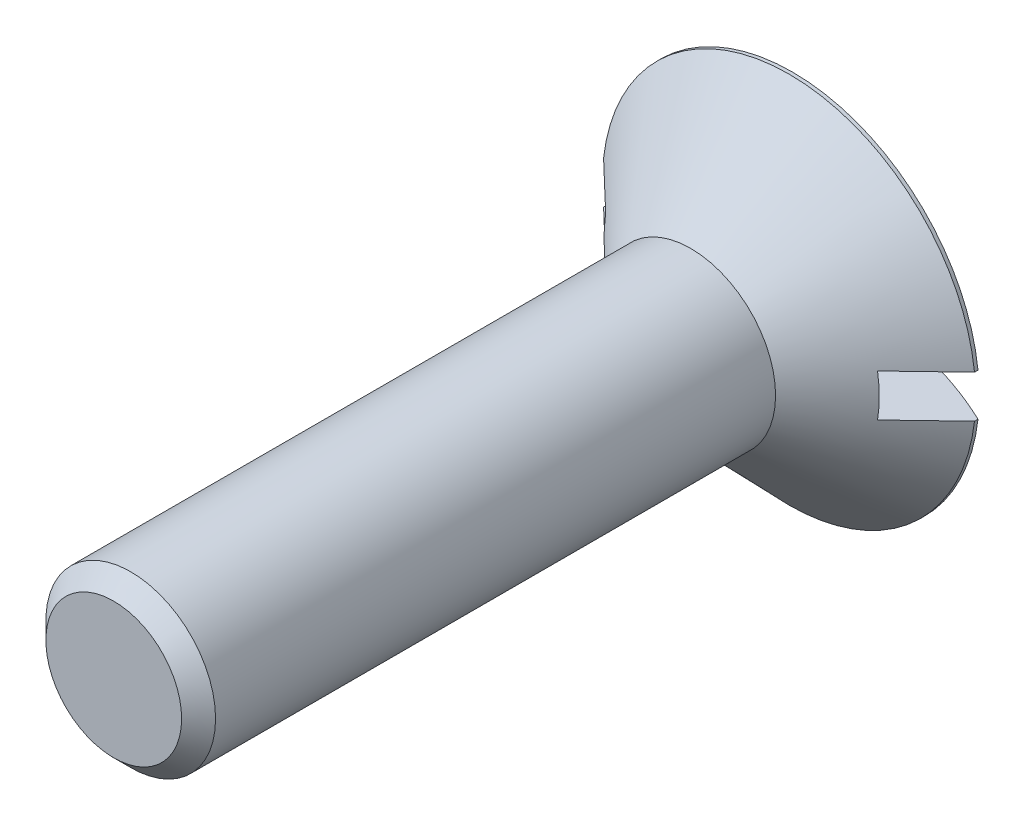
ISO-10303-21;
HEADER;
FILE_DESCRIPTION(('STEP AP214'),'2;1');
FILE_NAME('part.step','',(''),(''),'','','');
FILE_SCHEMA(('AUTOMOTIVE_DESIGN { 1 0 10303 214 1 1 1 1 }'));
ENDSEC;
DATA;
#1=APPLICATION_CONTEXT('core data for automotive mechanical design processes');
#2=APPLICATION_PROTOCOL_DEFINITION('international standard','automotive_design',2000,#1);
#3=PRODUCT_CONTEXT('',#1,'mechanical');
#4=PRODUCT('Part','Part','',(#3));
#5=PRODUCT_RELATED_PRODUCT_CATEGORY('part','',(#4));
#6=PRODUCT_DEFINITION_FORMATION('','',#4);
#7=PRODUCT_DEFINITION_CONTEXT('part definition',#1,'design');
#8=PRODUCT_DEFINITION('design','',#6,#7);
#9=PRODUCT_DEFINITION_SHAPE('','',#8);
#10=(LENGTH_UNIT() NAMED_UNIT(*) SI_UNIT(.MILLI.,.METRE.));
#11=(NAMED_UNIT(*) PLANE_ANGLE_UNIT() SI_UNIT($,.RADIAN.));
#12=(NAMED_UNIT(*) SI_UNIT($,.STERADIAN.) SOLID_ANGLE_UNIT());
#13=UNCERTAINTY_MEASURE_WITH_UNIT(LENGTH_MEASURE(1.E-05),#10,'distance_accuracy_value','');
#14=(GEOMETRIC_REPRESENTATION_CONTEXT(3) GLOBAL_UNCERTAINTY_ASSIGNED_CONTEXT((#13)) GLOBAL_UNIT_ASSIGNED_CONTEXT((#10,
#11,#12)) REPRESENTATION_CONTEXT('',''));
#15=CARTESIAN_POINT('',(0.,0.,0.));
#16=DIRECTION('',(0.,0.,1.));
#17=DIRECTION('',(1.,0.,0.));
#18=AXIS2_PLACEMENT_3D('',#15,#16,#17);
#19=CARTESIAN_POINT('',(0.,0.,0.));
#20=DIRECTION('',(0.,0.,-0.999999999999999));
#21=DIRECTION('',(-1.,0.,0.));
#22=AXIS2_PLACEMENT_3D('',#19,#20,#21);
#23=CYLINDRICAL_SURFACE('',#22,2.2);
#24=CARTESIAN_POINT('',(0.,0.,-1.15882652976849));
#25=DIRECTION('',(0.,0.,-0.999999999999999));
#26=DIRECTION('',(-1.,0.,0.));
#27=AXIS2_PLACEMENT_3D('',#24,#25,#26);
#28=CIRCLE('',#27,2.2);
#29=CARTESIAN_POINT('',(-2.18574929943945,0.250000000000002,-1.15882652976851));
#30=VERTEX_POINT('',#29);
#31=CARTESIAN_POINT('',(2.18574929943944,0.25,-1.15882652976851));
#32=VERTEX_POINT('',#31);
#33=EDGE_CURVE('E147',#30,#32,#28,.T.);
#34=ORIENTED_EDGE('',*,*,#33,.T.);
#35=DIRECTION('',(0.,0.,-0.999999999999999));
#36=VECTOR('',#35,1.);
#37=CARTESIAN_POINT('',(2.18574929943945,0.250000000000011,0.));
#38=LINE('',#37,#36);
#39=CARTESIAN_POINT('',(2.18574929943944,0.25,-1.20000000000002));
#40=VERTEX_POINT('',#39);
#41=EDGE_CURVE('E57',#32,#40,#38,.T.);
#42=ORIENTED_EDGE('',*,*,#41,.T.);
#43=CARTESIAN_POINT('',(0.,0.,-1.2));
#44=DIRECTION('',(0.,0.,-0.999999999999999));
#45=DIRECTION('',(-1.,0.,0.));
#46=AXIS2_PLACEMENT_3D('',#43,#44,#45);
#47=CIRCLE('',#46,2.2);
#48=CARTESIAN_POINT('',(-2.18574929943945,0.250000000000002,-1.20000000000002));
#49=VERTEX_POINT('',#48);
#50=EDGE_CURVE('E155',#49,#40,#47,.T.);
#51=ORIENTED_EDGE('',*,*,#50,.F.);
#52=DIRECTION('',(0.,0.,-0.999999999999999));
#53=VECTOR('',#52,1.);
#54=CARTESIAN_POINT('',(-2.18574929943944,0.250000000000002,0.));
#55=LINE('',#54,#53);
#56=EDGE_CURVE('E109',#49,#30,#55,.F.);
#57=ORIENTED_EDGE('',*,*,#56,.T.);
#58=EDGE_LOOP('',(#34,#42,#51,#57));
#59=FACE_BOUND('',#58,.T.);
#60=ADVANCED_FACE('F33',(#59),#23,.T.);
#61=CARTESIAN_POINT('',(0.,0.,3.38999999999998));
#62=DIRECTION('',(0.,0.,-0.999999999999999));
#63=DIRECTION('',(1.,0.,0.));
#64=AXIS2_PLACEMENT_3D('',#61,#62,#63);
#65=SPHERICAL_SURFACE('',#64,5.09);
#66=ORIENTED_EDGE('',*,*,#50,.T.);
#67=CARTESIAN_POINT('',(0.,0.249999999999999,3.38999999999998));
#68=DIRECTION('',(0.,1.,0.));
#69=DIRECTION('',(0.,0.,0.999999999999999));
#70=AXIS2_PLACEMENT_3D('',#67,#68,#69);
#71=CIRCLE('',#70,5.08385680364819);
#72=EDGE_CURVE('E153',#40,#49,#71,.T.);
#73=ORIENTED_EDGE('',*,*,#72,.T.);
#74=EDGE_LOOP('',(#66,#73));
#75=FACE_BOUND('',#74,.T.);
#76=ADVANCED_FACE('F133',(#75),#65,.T.);
#77=CARTESIAN_POINT('',(0.,0.,0.));
#78=DIRECTION('',(0.,0.,-0.999999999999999));
#79=DIRECTION('',(-1.,0.,0.));
#80=AXIS2_PLACEMENT_3D('',#77,#78,#79);
#81=CONICAL_SURFACE('',#80,1.,0.802851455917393);
#82=CARTESIAN_POINT('',(0.,0.,-0.6));
#83=DIRECTION('',(0.,0.,-0.999999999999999));
#84=DIRECTION('',(-1.,0.,0.));
#85=AXIS2_PLACEMENT_3D('',#82,#83,#84);
#86=CIRCLE('',#85,1.62131818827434);
#87=CARTESIAN_POINT('',(1.60192779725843,0.250000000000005,-0.600000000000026));
#88=VERTEX_POINT('',#87);
#89=CARTESIAN_POINT('',(1.60192779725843,-0.25,-0.599999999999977));
#90=VERTEX_POINT('',#89);
#91=EDGE_CURVE('E88',#88,#90,#86,.T.);
#92=ORIENTED_EDGE('',*,*,#91,.F.);
#93=CARTESIAN_POINT('',(-4.86140712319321,0.249999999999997,-3.73512103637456));
#94=CARTESIAN_POINT('',(-4.69409851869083,0.249999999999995,-3.5737679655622));
#95=CARTESIAN_POINT('',(-4.5267805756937,0.249999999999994,-3.41242457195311));
#96=CARTESIAN_POINT('',(-4.19211225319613,0.249999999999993,-3.08976822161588));
#97=CARTESIAN_POINT('',(-4.02476187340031,0.249999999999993,-2.92845526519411));
#98=CARTESIAN_POINT('',(-3.68998286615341,0.249999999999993,-2.60583998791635));
#99=CARTESIAN_POINT('',(-3.52255422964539,0.249999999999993,-2.44453767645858));
#100=CARTESIAN_POINT('',(-3.18763349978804,0.249999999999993,-2.12200206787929));
#101=CARTESIAN_POINT('',(-3.02014140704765,0.249999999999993,-1.96076877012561));
#102=CARTESIAN_POINT('',(-2.68004730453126,0.249999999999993,-1.63359802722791));
#103=CARTESIAN_POINT('',(-2.50744209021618,0.249999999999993,-1.46766391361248));
#104=CARTESIAN_POINT('',(-2.16203156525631,0.249999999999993,-1.13599426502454));
#105=CARTESIAN_POINT('',(-1.9892262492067,0.249999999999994,-0.970258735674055));
#106=CARTESIAN_POINT('',(-1.7297145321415,0.249999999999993,-0.721996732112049));
#107=CARTESIAN_POINT('',(-1.64316596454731,0.249999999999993,-0.639305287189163));
#108=CARTESIAN_POINT('',(-1.4698992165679,0.249999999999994,-0.474098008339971));
#109=CARTESIAN_POINT('',(-1.38318103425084,0.249999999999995,-0.391582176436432));
#110=CARTESIAN_POINT('',(-1.20946067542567,0.249999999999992,-0.226859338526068));
#111=CARTESIAN_POINT('',(-1.12245851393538,0.249999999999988,-0.144652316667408));
#112=CARTESIAN_POINT('',(-0.947929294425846,0.249999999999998,0.0192021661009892));
#113=CARTESIAN_POINT('',(-0.860402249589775,0.250000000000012,0.10084964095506));
#114=CARTESIAN_POINT('',(-0.749737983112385,0.249999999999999,0.202512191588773));
#115=CARTESIAN_POINT('',(-0.727178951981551,0.249999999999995,0.223155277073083));
#116=CARTESIAN_POINT('',(-0.681948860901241,0.249999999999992,0.264318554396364));
#117=CARTESIAN_POINT('',(-0.659277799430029,0.249999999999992,0.284838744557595));
#118=CARTESIAN_POINT('',(-0.591184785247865,0.249999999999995,0.346053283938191));
#119=CARTESIAN_POINT('',(-0.545555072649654,0.249999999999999,0.386519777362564));
#120=CARTESIAN_POINT('',(-0.468454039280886,0.249999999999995,0.453089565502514));
#121=CARTESIAN_POINT('',(-0.437274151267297,0.249999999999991,0.479530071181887));
#122=CARTESIAN_POINT('',(-0.373959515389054,0.249999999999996,0.53160132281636));
#123=CARTESIAN_POINT('',(-0.341820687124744,0.250000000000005,0.557227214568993));
#124=CARTESIAN_POINT('',(-0.292338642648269,0.25,0.594362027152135));
#125=CARTESIAN_POINT('',(-0.275536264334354,0.249999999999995,0.606586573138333));
#126=CARTESIAN_POINT('',(-0.241409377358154,0.249999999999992,0.630278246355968));
#127=CARTESIAN_POINT('',(-0.224085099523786,0.249999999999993,0.641745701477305));
#128=CARTESIAN_POINT('',(-0.188815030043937,0.249999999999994,0.663431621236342));
#129=CARTESIAN_POINT('',(-0.170874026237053,0.249999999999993,0.673657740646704));
#130=CARTESIAN_POINT('',(-0.134038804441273,0.249999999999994,0.692175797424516));
#131=CARTESIAN_POINT('',(-0.115147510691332,0.249999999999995,0.70047327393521));
#132=CARTESIAN_POINT('',(-0.0803697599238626,0.249999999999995,0.712471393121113));
#133=CARTESIAN_POINT('',(-0.0647001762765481,0.249999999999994,0.716774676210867));
#134=CARTESIAN_POINT('',(-0.0328905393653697,0.249999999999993,0.72264730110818));
#135=CARTESIAN_POINT('',(-0.0167527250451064,0.249999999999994,0.724227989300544));
#136=CARTESIAN_POINT('',(0.0155936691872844,0.249999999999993,0.724303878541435));
#137=CARTESIAN_POINT('',(0.0318022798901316,0.249999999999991,0.722787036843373));
#138=CARTESIAN_POINT('',(0.0637518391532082,0.249999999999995,0.717007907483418));
#139=CARTESIAN_POINT('',(0.0794907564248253,0.250000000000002,0.712735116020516));
#140=CARTESIAN_POINT('',(0.112072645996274,0.250000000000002,0.701576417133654));
#141=CARTESIAN_POINT('',(0.128826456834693,0.249999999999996,0.694441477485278));
#142=CARTESIAN_POINT('',(0.161567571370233,0.249999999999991,0.678563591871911));
#143=CARTESIAN_POINT('',(0.177553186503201,0.249999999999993,0.669817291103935));
#144=CARTESIAN_POINT('',(0.20903325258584,0.249999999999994,0.651225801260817));
#145=CARTESIAN_POINT('',(0.224522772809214,0.249999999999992,0.641372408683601));
#146=CARTESIAN_POINT('',(0.255018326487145,0.249999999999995,0.620984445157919));
#147=CARTESIAN_POINT('',(0.270024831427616,0.249999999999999,0.610450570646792));
#148=CARTESIAN_POINT('',(0.317724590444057,0.250000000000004,0.575843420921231));
#149=CARTESIAN_POINT('',(0.349758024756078,0.249999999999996,0.550867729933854));
#150=CARTESIAN_POINT('',(0.41294269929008,0.24999999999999,0.499818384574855));
#151=CARTESIAN_POINT('',(0.444093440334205,0.249999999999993,0.473744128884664));
#152=CARTESIAN_POINT('',(0.505905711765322,0.249999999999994,0.420923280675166));
#153=CARTESIAN_POINT('',(0.536566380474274,0.249999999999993,0.394175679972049));
#154=CARTESIAN_POINT('',(0.59753469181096,0.249999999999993,0.340298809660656));
#155=CARTESIAN_POINT('',(0.627842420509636,0.249999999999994,0.313169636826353));
#156=CARTESIAN_POINT('',(0.718178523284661,0.249999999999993,0.231628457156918));
#157=CARTESIAN_POINT('',(0.777870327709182,0.24999999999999,0.17684410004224));
#158=CARTESIAN_POINT('',(0.896743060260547,0.249999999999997,0.0668337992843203));
#159=CARTESIAN_POINT('',(0.955924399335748,0.250000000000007,0.0116082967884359));
#160=CARTESIAN_POINT('',(1.13271176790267,0.250000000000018,-0.154142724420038));
#161=CARTESIAN_POINT('',(1.24992974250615,0.25,-0.265081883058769));
#162=CARTESIAN_POINT('',(1.48394572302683,0.249999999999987,-0.487404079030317));
#163=CARTESIAN_POINT('',(1.60074372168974,0.249999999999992,-0.598787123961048));
#164=CARTESIAN_POINT('',(1.83415197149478,0.249999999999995,-0.821833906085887));
#165=CARTESIAN_POINT('',(1.95076214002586,0.249999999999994,-0.93349772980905));
#166=CARTESIAN_POINT('',(2.18384967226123,0.249999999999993,-1.15696223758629));
#167=CARTESIAN_POINT('',(2.30032703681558,0.249999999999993,-1.26876292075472));
#168=CARTESIAN_POINT('',(2.64978088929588,0.249999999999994,-1.60443163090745));
#169=CARTESIAN_POINT('',(2.88263439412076,0.249999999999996,-1.82842769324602));
#170=CARTESIAN_POINT('',(3.34816980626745,0.249999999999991,-2.27655461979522));
#171=CARTESIAN_POINT('',(3.58085172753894,0.249999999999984,-2.50068546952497));
#172=CARTESIAN_POINT('',(3.90085212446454,0.249999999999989,-2.80904465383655));
#173=CARTESIAN_POINT('',(3.98820767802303,0.249999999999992,-2.89323450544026));
#174=CARTESIAN_POINT('',(4.16291039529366,0.249999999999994,-3.06162641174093));
#175=CARTESIAN_POINT('',(4.25025755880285,0.249999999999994,-3.14582846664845));
#176=CARTESIAN_POINT('',(4.42491001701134,0.249999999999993,-3.31420894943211));
#177=CARTESIAN_POINT('',(4.51221531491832,0.249999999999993,-3.3983873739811));
#178=CARTESIAN_POINT('',(4.68681708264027,0.249999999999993,-3.56674987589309));
#179=CARTESIAN_POINT('',(4.77411355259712,0.249999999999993,-3.65093395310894));
#180=CARTESIAN_POINT('',(4.86140712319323,0.249999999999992,-3.73512103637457));
#181=B_SPLINE_CURVE_WITH_KNOTS('',3,(#93,#94,#95,#96,#97,#98,#99,#100,#101,#102,#103,#104,#105,
#106,#107,#108,#109,#110,#111,#112,#113,#114,#115,#116,#117,#118,#119,#120,#121,#122,#123,#124,
#125,#126,#127,#128,#129,#130,#131,#132,#133,#134,#135,#136,#137,#138,#139,#140,#141,#142,#143,
#144,#145,#146,#147,#148,#149,#150,#151,#152,#153,#154,#155,#156,#157,#158,#159,#160,#161,#162,
#163,#164,#165,#166,#167,#168,#169,#170,#171,#172,#173,#174,#175,#176,#177,#178,#179,#180),
.UNSPECIFIED.,.F.,.F.,(4,2,2,2,2,2,2,2,2,2,2,2,2,2,2,2,2,2,2,2,2,2,2,2,2,2,2,2,2,2,2,2,2,2,2,2,
2,2,2,2,2,2,2,4),(0.,0.697311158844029,1.39462899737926,2.0920937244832,2.7895519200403,
3.50784168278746,4.22615132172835,4.58525675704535,4.94436630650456,5.30345716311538,
5.66253903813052,5.75427410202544,5.84601041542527,6.02896056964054,6.15159884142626,
6.27486673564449,6.3371906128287,6.39948731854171,6.46137791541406,6.52308850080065,
6.57165687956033,6.6200223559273,6.66857622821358,6.71731625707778,6.77181304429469,
6.82642460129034,6.88147146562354,6.93646285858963,7.05825778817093,7.18012027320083,
7.30217757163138,7.4242044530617,7.66726075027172,7.91009859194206,8.39427174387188,
8.87845321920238,9.36280879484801,9.84716125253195,10.8164674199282,11.7856834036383,
12.1496481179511,12.5136201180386,12.8774524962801,13.2412775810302),.UNSPECIFIED.);
#182=EDGE_CURVE('E187',#88,#32,#181,.T.);
#183=ORIENTED_EDGE('',*,*,#182,.T.);
#184=ORIENTED_EDGE('',*,*,#33,.F.);
#185=CARTESIAN_POINT('',(-1.60192779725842,0.249999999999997,-0.600000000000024));
#186=VERTEX_POINT('',#185);
#187=EDGE_CURVE('E184',#30,#186,#181,.T.);
#188=ORIENTED_EDGE('',*,*,#187,.T.);
#189=CARTESIAN_POINT('',(-1.60192779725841,-0.249999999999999,-0.599999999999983));
#190=VERTEX_POINT('',#189);
#191=EDGE_CURVE('E97',#190,#186,#86,.T.);
#192=ORIENTED_EDGE('',*,*,#191,.F.);
#193=CARTESIAN_POINT('',(4.86140712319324,-0.250000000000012,-3.73512103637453));
#194=CARTESIAN_POINT('',(4.69409851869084,-0.250000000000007,-3.57376796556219));
#195=CARTESIAN_POINT('',(4.52678057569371,-0.250000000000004,-3.41242457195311));
#196=CARTESIAN_POINT('',(4.19211225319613,-0.250000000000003,-3.08976822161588));
#197=CARTESIAN_POINT('',(4.02476187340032,-0.250000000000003,-2.92845526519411));
#198=CARTESIAN_POINT('',(3.68998286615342,-0.250000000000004,-2.60583998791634));
#199=CARTESIAN_POINT('',(3.52255422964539,-0.250000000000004,-2.44453767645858));
#200=CARTESIAN_POINT('',(3.18763349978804,-0.250000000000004,-2.12200206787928));
#201=CARTESIAN_POINT('',(3.02014140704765,-0.250000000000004,-1.9607687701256));
#202=CARTESIAN_POINT('',(2.68004730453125,-0.250000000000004,-1.6335980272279));
#203=CARTESIAN_POINT('',(2.50744209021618,-0.250000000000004,-1.46766391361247));
#204=CARTESIAN_POINT('',(2.1620315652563,-0.250000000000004,-1.13599426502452));
#205=CARTESIAN_POINT('',(1.98922624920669,-0.250000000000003,-0.970258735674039));
#206=CARTESIAN_POINT('',(1.72971453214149,-0.250000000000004,-0.721996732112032));
#207=CARTESIAN_POINT('',(1.6431659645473,-0.250000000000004,-0.639305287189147));
#208=CARTESIAN_POINT('',(1.46989921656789,-0.250000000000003,-0.474098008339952));
#209=CARTESIAN_POINT('',(1.38318103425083,-0.250000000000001,-0.391582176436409));
#210=CARTESIAN_POINT('',(1.20946067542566,-0.250000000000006,-0.226859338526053));
#211=CARTESIAN_POINT('',(1.12245851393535,-0.250000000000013,-0.144652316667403));
#212=CARTESIAN_POINT('',(0.947929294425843,-0.249999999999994,0.0192021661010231));
#213=CARTESIAN_POINT('',(0.86040224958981,-0.249999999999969,0.100849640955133));
#214=CARTESIAN_POINT('',(0.749737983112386,-0.249999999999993,0.202512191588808));
#215=CARTESIAN_POINT('',(0.727178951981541,-0.250000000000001,0.223155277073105));
#216=CARTESIAN_POINT('',(0.681948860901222,-0.250000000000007,0.264318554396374));
#217=CARTESIAN_POINT('',(0.659277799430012,-0.250000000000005,0.284838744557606));
#218=CARTESIAN_POINT('',(0.59118478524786,-0.250000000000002,0.346053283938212));
#219=CARTESIAN_POINT('',(0.545555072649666,-0.250000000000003,0.386519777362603));
#220=CARTESIAN_POINT('',(0.468454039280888,-0.250000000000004,0.453089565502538));
#221=CARTESIAN_POINT('',(0.437274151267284,-0.250000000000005,0.479530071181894));
#222=CARTESIAN_POINT('',(0.373959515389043,-0.250000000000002,0.531601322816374));
#223=CARTESIAN_POINT('',(0.341820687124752,-0.249999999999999,0.557227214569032));
#224=CARTESIAN_POINT('',(0.292338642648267,-0.250000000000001,0.59436202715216));
#225=CARTESIAN_POINT('',(0.275536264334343,-0.250000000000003,0.606586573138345));
#226=CARTESIAN_POINT('',(0.241409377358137,-0.250000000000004,0.630278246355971));
#227=CARTESIAN_POINT('',(0.224085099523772,-0.250000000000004,0.641745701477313));
#228=CARTESIAN_POINT('',(0.188815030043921,-0.250000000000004,0.663431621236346));
#229=CARTESIAN_POINT('',(0.170874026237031,-0.250000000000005,0.673657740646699));
#230=CARTESIAN_POINT('',(0.134038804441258,-0.250000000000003,0.692175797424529));
#231=CARTESIAN_POINT('',(0.11514751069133,-0.25,0.70047327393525));
#232=CARTESIAN_POINT('',(0.0803697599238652,-0.250000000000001,0.712471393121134));
#233=CARTESIAN_POINT('',(0.0647001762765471,-0.250000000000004,0.716774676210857));
#234=CARTESIAN_POINT('',(0.0328905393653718,-0.250000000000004,0.722647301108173));
#235=CARTESIAN_POINT('',(0.0167527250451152,-0.250000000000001,0.724227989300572));
#236=CARTESIAN_POINT('',(-0.0155936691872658,-0.25,0.724303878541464));
#237=CARTESIAN_POINT('',(-0.03180227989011,-0.250000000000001,0.722787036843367));
#238=CARTESIAN_POINT('',(-0.0637518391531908,-0.250000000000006,0.717007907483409));
#239=CARTESIAN_POINT('',(-0.0794907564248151,-0.250000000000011,0.71273511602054));
#240=CARTESIAN_POINT('',(-0.112072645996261,-0.250000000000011,0.70157641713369));
#241=CARTESIAN_POINT('',(-0.128826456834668,-0.250000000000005,0.694441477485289));
#242=CARTESIAN_POINT('',(-0.1615675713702,-0.250000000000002,0.678563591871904));
#243=CARTESIAN_POINT('',(-0.177553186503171,-0.250000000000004,0.669817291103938));
#244=CARTESIAN_POINT('',(-0.209033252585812,-0.250000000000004,0.651225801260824));
#245=CARTESIAN_POINT('',(-0.224522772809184,-0.250000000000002,0.641372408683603));
#246=CARTESIAN_POINT('',(-0.25501832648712,-0.250000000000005,0.620984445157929));
#247=CARTESIAN_POINT('',(-0.270024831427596,-0.250000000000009,0.610450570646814));
#248=CARTESIAN_POINT('',(-0.317724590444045,-0.250000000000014,0.575843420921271));
#249=CARTESIAN_POINT('',(-0.349758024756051,-0.250000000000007,0.550867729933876));
#250=CARTESIAN_POINT('',(-0.412942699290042,-0.250000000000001,0.499818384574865));
#251=CARTESIAN_POINT('',(-0.44409344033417,-0.250000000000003,0.473744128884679));
#252=CARTESIAN_POINT('',(-0.505905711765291,-0.250000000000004,0.420923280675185));
#253=CARTESIAN_POINT('',(-0.536566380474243,-0.250000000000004,0.394175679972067));
#254=CARTESIAN_POINT('',(-0.597534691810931,-0.250000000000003,0.340298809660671));
#255=CARTESIAN_POINT('',(-0.627842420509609,-0.250000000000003,0.313169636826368));
#256=CARTESIAN_POINT('',(-0.718178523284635,-0.250000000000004,0.231628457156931));
#257=CARTESIAN_POINT('',(-0.777870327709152,-0.250000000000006,0.176844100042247));
#258=CARTESIAN_POINT('',(-0.896743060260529,-0.250000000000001,0.0668337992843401));
#259=CARTESIAN_POINT('',(-0.955924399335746,-0.249999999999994,0.011608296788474));
#260=CARTESIAN_POINT('',(-1.13271176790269,-0.249999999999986,-0.154142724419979));
#261=CARTESIAN_POINT('',(-1.24992974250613,-0.249999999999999,-0.26508188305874));
#262=CARTESIAN_POINT('',(-1.48394572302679,-0.250000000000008,-0.48740407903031));
#263=CARTESIAN_POINT('',(-1.60074372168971,-0.250000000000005,-0.598787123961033));
#264=CARTESIAN_POINT('',(-1.83415197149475,-0.250000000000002,-0.821833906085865));
#265=CARTESIAN_POINT('',(-1.95076214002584,-0.250000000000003,-0.933497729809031));
#266=CARTESIAN_POINT('',(-2.1838496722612,-0.250000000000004,-1.15696223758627));
#267=CARTESIAN_POINT('',(-2.30032703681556,-0.250000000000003,-1.2687629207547));
#268=CARTESIAN_POINT('',(-2.64978088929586,-0.250000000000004,-1.60443163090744));
#269=CARTESIAN_POINT('',(-2.88263439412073,-0.250000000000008,-1.82842769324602));
#270=CARTESIAN_POINT('',(-3.34816980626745,-0.249999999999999,-2.2765546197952));
#271=CARTESIAN_POINT('',(-3.58085172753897,-0.249999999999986,-2.50068546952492));
#272=CARTESIAN_POINT('',(-3.90085212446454,-0.249999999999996,-2.80904465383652));
#273=CARTESIAN_POINT('',(-3.98820767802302,-0.250000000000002,-2.89323450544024));
#274=CARTESIAN_POINT('',(-4.16291039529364,-0.250000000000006,-3.06162641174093));
#275=CARTESIAN_POINT('',(-4.25025755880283,-0.250000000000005,-3.14582846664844));
#276=CARTESIAN_POINT('',(-4.42491001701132,-0.250000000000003,-3.3142089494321));
#277=CARTESIAN_POINT('',(-4.5122153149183,-0.250000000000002,-3.39838737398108));
#278=CARTESIAN_POINT('',(-4.68681708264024,-0.250000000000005,-3.56674987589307));
#279=CARTESIAN_POINT('',(-4.7741135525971,-0.250000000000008,-3.65093395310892));
#280=CARTESIAN_POINT('',(-4.86140712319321,-0.250000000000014,-3.73512103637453));
#281=B_SPLINE_CURVE_WITH_KNOTS('',3,(#193,#194,#195,#196,#197,#198,#199,#200,#201,#202,#203,
#204,#205,#206,#207,#208,#209,#210,#211,#212,#213,#214,#215,#216,#217,#218,#219,#220,#221,#222,
#223,#224,#225,#226,#227,#228,#229,#230,#231,#232,#233,#234,#235,#236,#237,#238,#239,#240,#241,
#242,#243,#244,#245,#246,#247,#248,#249,#250,#251,#252,#253,#254,#255,#256,#257,#258,#259,#260,
#261,#262,#263,#264,#265,#266,#267,#268,#269,#270,#271,#272,#273,#274,#275,#276,#277,#278,#279,
#280),.UNSPECIFIED.,.F.,.F.,(4,2,2,2,2,2,2,2,2,2,2,2,2,2,2,2,2,2,2,2,2,2,2,2,2,2,2,2,2,2,2,2,2,
2,2,2,2,2,2,2,2,2,2,4),(0.,0.697311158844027,1.39462899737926,2.0920937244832,2.78955192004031,
3.50784168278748,4.22615132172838,4.58525675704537,4.94436630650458,5.30345716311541,
5.66253903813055,5.75427410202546,5.84601041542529,6.02896056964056,6.15159884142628,
6.27486673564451,6.33719061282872,6.39948731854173,6.46137791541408,6.52308850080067,
6.57165687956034,6.6200223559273,6.66857622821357,6.71731625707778,6.77181304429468,
6.82642460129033,6.88147146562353,6.93646285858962,7.05825778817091,7.18012027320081,
7.30217757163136,7.42420445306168,7.66726075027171,7.91009859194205,8.39427174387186,
8.87845321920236,9.362808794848,9.84716125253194,10.8164674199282,11.7856834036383,
12.1496481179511,12.5136201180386,12.8774524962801,13.2412775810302),.UNSPECIFIED.);
#282=CARTESIAN_POINT('',(-2.18574929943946,-0.24999999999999,-1.15882652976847));
#283=VERTEX_POINT('',#282);
#284=EDGE_CURVE('E102',#190,#283,#281,.T.);
#285=ORIENTED_EDGE('',*,*,#284,.T.);
#286=CARTESIAN_POINT('',(2.18574929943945,-0.250000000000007,-1.15882652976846));
#287=VERTEX_POINT('',#286);
#288=EDGE_CURVE('E108',#287,#283,#28,.T.);
#289=ORIENTED_EDGE('',*,*,#288,.F.);
#290=EDGE_CURVE('E100',#287,#90,#281,.T.);
#291=ORIENTED_EDGE('',*,*,#290,.T.);
#292=EDGE_LOOP('',(#92,#183,#184,#188,#192,#285,#289,#291));
#293=FACE_BOUND('',#292,.T.);
#294=CARTESIAN_POINT('',(0.,0.,0.));
#295=DIRECTION('',(0.,0.,0.999999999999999));
#296=DIRECTION('',(1.,0.,0.));
#297=AXIS2_PLACEMENT_3D('',#294,#295,#296);
#298=CIRCLE('',#297,1.);
#299=CARTESIAN_POINT('',(1.00000000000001,0.,0.));
#300=VERTEX_POINT('',#299);
#301=EDGE_CURVE('E103',#300,#300,#298,.T.);
#302=ORIENTED_EDGE('',*,*,#301,.F.);
#303=EDGE_LOOP('',(#302));
#304=FACE_BOUND('',#303,.T.);
#305=ADVANCED_FACE('F35',(#293,#304),#81,.T.);
#306=ORIENTED_EDGE('',*,*,#288,.T.);
#307=DIRECTION('',(0.,0.,-0.999999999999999));
#308=VECTOR('',#307,1.);
#309=CARTESIAN_POINT('',(-2.18574929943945,-0.249999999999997,0.));
#310=LINE('',#309,#308);
#311=CARTESIAN_POINT('',(-2.18574929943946,-0.24999999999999,-1.19999999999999));
#312=VERTEX_POINT('',#311);
#313=EDGE_CURVE('E113',#283,#312,#310,.T.);
#314=ORIENTED_EDGE('',*,*,#313,.T.);
#315=CARTESIAN_POINT('',(2.18574929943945,-0.250000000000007,-1.19999999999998));
#316=VERTEX_POINT('',#315);
#317=EDGE_CURVE('E157',#316,#312,#47,.T.);
#318=ORIENTED_EDGE('',*,*,#317,.F.);
#319=DIRECTION('',(0.,0.,-0.999999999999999));
#320=VECTOR('',#319,1.);
#321=CARTESIAN_POINT('',(2.18574929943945,-0.249999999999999,0.));
#322=LINE('',#321,#320);
#323=EDGE_CURVE('E49',#316,#287,#322,.F.);
#324=ORIENTED_EDGE('',*,*,#323,.T.);
#325=EDGE_LOOP('',(#306,#314,#318,#324));
#326=FACE_BOUND('',#325,.T.);
#327=ADVANCED_FACE('F131',(#326),#23,.T.);
#328=ORIENTED_EDGE('',*,*,#317,.T.);
#329=CARTESIAN_POINT('',(0.,-0.250000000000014,3.39));
#330=DIRECTION('',(0.,-1.,0.));
#331=DIRECTION('',(0.,0.,-0.999999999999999));
#332=AXIS2_PLACEMENT_3D('',#329,#330,#331);
#333=CIRCLE('',#332,5.08385680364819);
#334=EDGE_CURVE('E151',#312,#316,#333,.T.);
#335=ORIENTED_EDGE('',*,*,#334,.T.);
#336=EDGE_LOOP('',(#328,#335));
#337=FACE_BOUND('',#336,.T.);
#338=ADVANCED_FACE('F129',(#337),#65,.T.);
#339=CARTESIAN_POINT('',(2.20000000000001,-0.250000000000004,-0.599999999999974));
#340=DIRECTION('',(0.,0.,-0.999999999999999));
#341=DIRECTION('',(-1.,0.,0.));
#342=AXIS2_PLACEMENT_3D('',#339,#340,#341);
#343=PLANE('',#342);
#344=ORIENTED_EDGE('',*,*,#91,.T.);
#345=DIRECTION('',(-1.,0.,0.));
#346=VECTOR('',#345,1.);
#347=CARTESIAN_POINT('',(2.20000000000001,-0.250000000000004,-0.599999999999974));
#348=LINE('',#347,#346);
#349=EDGE_CURVE('E91',#90,#190,#348,.T.);
#350=ORIENTED_EDGE('',*,*,#349,.T.);
#351=ORIENTED_EDGE('',*,*,#191,.T.);
#352=DIRECTION('',(1.,0.,0.));
#353=VECTOR('',#352,1.);
#354=CARTESIAN_POINT('',(2.2,0.249999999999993,-0.600000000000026));
#355=LINE('',#354,#353);
#356=EDGE_CURVE('E94',#186,#88,#355,.T.);
#357=ORIENTED_EDGE('',*,*,#356,.T.);
#358=EDGE_LOOP('',(#344,#350,#351,#357));
#359=FACE_BOUND('',#358,.T.);
#360=ADVANCED_FACE('F90',(#359),#343,.T.);
#361=CARTESIAN_POINT('',(2.2,0.249999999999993,-0.600000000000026));
#362=DIRECTION('',(0.,1.,0.));
#363=DIRECTION('',(0.,0.,0.999999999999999));
#364=AXIS2_PLACEMENT_3D('',#361,#362,#363);
#365=PLANE('',#364);
#366=ORIENTED_EDGE('',*,*,#56,.F.);
#367=ORIENTED_EDGE('',*,*,#72,.F.);
#368=ORIENTED_EDGE('',*,*,#41,.F.);
#369=ORIENTED_EDGE('',*,*,#182,.F.);
#370=ORIENTED_EDGE('',*,*,#356,.F.);
#371=ORIENTED_EDGE('',*,*,#187,.F.);
#372=EDGE_LOOP('',(#366,#367,#368,#369,#370,#371));
#373=FACE_BOUND('',#372,.T.);
#374=ADVANCED_FACE('F126',(#373),#365,.F.);
#375=CARTESIAN_POINT('',(2.20000000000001,-0.250000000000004,-0.599999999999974));
#376=DIRECTION('',(0.,-1.,0.));
#377=DIRECTION('',(0.,0.,-0.999999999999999));
#378=AXIS2_PLACEMENT_3D('',#375,#376,#377);
#379=PLANE('',#378);
#380=ORIENTED_EDGE('',*,*,#323,.F.);
#381=ORIENTED_EDGE('',*,*,#334,.F.);
#382=ORIENTED_EDGE('',*,*,#313,.F.);
#383=ORIENTED_EDGE('',*,*,#284,.F.);
#384=ORIENTED_EDGE('',*,*,#349,.F.);
#385=ORIENTED_EDGE('',*,*,#290,.F.);
#386=EDGE_LOOP('',(#380,#381,#382,#383,#384,#385));
#387=FACE_BOUND('',#386,.T.);
#388=ADVANCED_FACE('F99',(#387),#379,.F.);
#389=CARTESIAN_POINT('',(0.,0.,6.79999999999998));
#390=DIRECTION('',(0.,0.,0.999999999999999));
#391=DIRECTION('',(1.,0.,0.));
#392=AXIS2_PLACEMENT_3D('',#389,#390,#391);
#393=PLANE('',#392);
#394=CARTESIAN_POINT('',(0.,0.,6.79999999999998));
#395=DIRECTION('',(0.,0.,0.999999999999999));
#396=DIRECTION('',(1.,0.,0.));
#397=AXIS2_PLACEMENT_3D('',#394,#395,#396);
#398=CIRCLE('',#397,0.800000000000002);
#399=CARTESIAN_POINT('',(0.800000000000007,0.,6.79999999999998));
#400=VERTEX_POINT('',#399);
#401=EDGE_CURVE('E42',#400,#400,#398,.T.);
#402=ORIENTED_EDGE('',*,*,#401,.T.);
#403=EDGE_LOOP('',(#402));
#404=FACE_BOUND('',#403,.T.);
#405=ADVANCED_FACE('F125',(#404),#393,.T.);
#406=CARTESIAN_POINT('',(0.,0.,0.));
#407=DIRECTION('',(0.,0.,0.999999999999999));
#408=DIRECTION('',(1.,0.,0.));
#409=AXIS2_PLACEMENT_3D('',#406,#407,#408);
#410=CYLINDRICAL_SURFACE('',#409,1.);
#411=CARTESIAN_POINT('',(0.,0.,6.59999999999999));
#412=DIRECTION('',(0.,0.,0.999999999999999));
#413=DIRECTION('',(1.,0.,0.));
#414=AXIS2_PLACEMENT_3D('',#411,#412,#413);
#415=CIRCLE('',#414,1.);
#416=CARTESIAN_POINT('',(1.00000000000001,0.,6.59999999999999));
#417=VERTEX_POINT('',#416);
#418=EDGE_CURVE('E11',#417,#417,#415,.F.);
#419=CARTESIAN_POINT('',(1.00000000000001,0.,6.59999999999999));
#420=CARTESIAN_POINT('',(1.00000000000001,0.,6.53124999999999));
#421=CARTESIAN_POINT('',(1.00000000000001,0.,6.46249999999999));
#422=CARTESIAN_POINT('',(1.00000000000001,0.,6.32499999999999));
#423=CARTESIAN_POINT('',(1.00000000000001,0.,6.25624999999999));
#424=CARTESIAN_POINT('',(1.00000000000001,0.,6.11874999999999));
#425=CARTESIAN_POINT('',(1.00000000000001,0.,6.04999999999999));
#426=CARTESIAN_POINT('',(1.00000000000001,0.,5.91249999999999));
#427=CARTESIAN_POINT('',(1.00000000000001,0.,5.84374999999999));
#428=CARTESIAN_POINT('',(1.00000000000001,0.,5.70624999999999));
#429=CARTESIAN_POINT('',(1.00000000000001,0.,5.63749999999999));
#430=CARTESIAN_POINT('',(1.00000000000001,0.,5.49999999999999));
#431=CARTESIAN_POINT('',(1.00000000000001,0.,5.43124999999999));
#432=CARTESIAN_POINT('',(1.00000000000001,0.,5.29374999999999));
#433=CARTESIAN_POINT('',(1.00000000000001,0.,5.22499999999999));
#434=CARTESIAN_POINT('',(1.00000000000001,0.,5.08749999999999));
#435=CARTESIAN_POINT('',(1.00000000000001,0.,5.01874999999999));
#436=CARTESIAN_POINT('',(1.00000000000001,0.,4.88124999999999));
#437=CARTESIAN_POINT('',(1.00000000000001,0.,4.81249999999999));
#438=CARTESIAN_POINT('',(1.00000000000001,0.,4.67499999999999));
#439=CARTESIAN_POINT('',(1.00000000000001,0.,4.60624999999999));
#440=CARTESIAN_POINT('',(1.00000000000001,0.,4.46874999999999));
#441=CARTESIAN_POINT('',(1.00000000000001,0.,4.39999999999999));
#442=CARTESIAN_POINT('',(1.00000000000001,0.,4.26249999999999));
#443=CARTESIAN_POINT('',(1.00000000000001,0.,4.19374999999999));
#444=CARTESIAN_POINT('',(1.00000000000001,0.,4.05624999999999));
#445=CARTESIAN_POINT('',(1.00000000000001,0.,3.98749999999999));
#446=CARTESIAN_POINT('',(1.00000000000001,0.,3.84999999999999));
#447=CARTESIAN_POINT('',(1.00000000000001,0.,3.78124999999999));
#448=CARTESIAN_POINT('',(1.00000000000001,0.,3.64374999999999));
#449=CARTESIAN_POINT('',(1.00000000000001,0.,3.57499999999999));
#450=CARTESIAN_POINT('',(1.00000000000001,0.,3.43749999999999));
#451=CARTESIAN_POINT('',(1.00000000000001,0.,3.36874999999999));
#452=CARTESIAN_POINT('',(1.00000000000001,0.,3.23124999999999));
#453=CARTESIAN_POINT('',(1.00000000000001,0.,3.16249999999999));
#454=CARTESIAN_POINT('',(1.00000000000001,0.,3.02499999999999));
#455=CARTESIAN_POINT('',(1.00000000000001,0.,2.95624999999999));
#456=CARTESIAN_POINT('',(1.00000000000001,0.,2.81874999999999));
#457=CARTESIAN_POINT('',(1.00000000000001,0.,2.74999999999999));
#458=CARTESIAN_POINT('',(1.00000000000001,0.,2.61249999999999));
#459=CARTESIAN_POINT('',(1.00000000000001,0.,2.54374999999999));
#460=CARTESIAN_POINT('',(1.00000000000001,0.,2.40624999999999));
#461=CARTESIAN_POINT('',(1.00000000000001,0.,2.3375));
#462=CARTESIAN_POINT('',(1.00000000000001,0.,2.2));
#463=CARTESIAN_POINT('',(1.00000000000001,0.,2.13125));
#464=CARTESIAN_POINT('',(1.00000000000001,0.,1.99375));
#465=CARTESIAN_POINT('',(1.00000000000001,0.,1.925));
#466=CARTESIAN_POINT('',(1.00000000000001,0.,1.7875));
#467=CARTESIAN_POINT('',(1.00000000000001,0.,1.71875));
#468=CARTESIAN_POINT('',(1.00000000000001,0.,1.58125));
#469=CARTESIAN_POINT('',(1.00000000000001,0.,1.5125));
#470=CARTESIAN_POINT('',(1.00000000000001,0.,1.375));
#471=CARTESIAN_POINT('',(1.00000000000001,0.,1.30625));
#472=CARTESIAN_POINT('',(1.00000000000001,0.,1.16875));
#473=CARTESIAN_POINT('',(1.00000000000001,0.,1.1));
#474=CARTESIAN_POINT('',(1.00000000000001,0.,0.962499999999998));
#475=CARTESIAN_POINT('',(1.00000000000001,0.,0.893749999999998));
#476=CARTESIAN_POINT('',(1.00000000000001,0.,0.756249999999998));
#477=CARTESIAN_POINT('',(1.00000000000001,0.,0.687499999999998));
#478=CARTESIAN_POINT('',(1.00000000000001,0.,0.549999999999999));
#479=CARTESIAN_POINT('',(1.00000000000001,0.,0.481249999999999));
#480=CARTESIAN_POINT('',(1.00000000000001,0.,0.343749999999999));
#481=CARTESIAN_POINT('',(1.00000000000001,0.,0.274999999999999));
#482=CARTESIAN_POINT('',(1.00000000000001,0.,0.1375));
#483=CARTESIAN_POINT('',(1.00000000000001,0.,0.0687499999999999));
#484=CARTESIAN_POINT('',(1.00000000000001,0.,0.));
#485=B_SPLINE_CURVE_WITH_KNOTS('',3,(#419,#420,#421,#422,#423,#424,#425,#426,#427,#428,#429,
#430,#431,#432,#433,#434,#435,#436,#437,#438,#439,#440,#441,#442,#443,#444,#445,#446,#447,#448,
#449,#450,#451,#452,#453,#454,#455,#456,#457,#458,#459,#460,#461,#462,#463,#464,#465,#466,#467,
#468,#469,#470,#471,#472,#473,#474,#475,#476,#477,#478,#479,#480,#481,#482,#483,#484),
.UNSPECIFIED.,.F.,.F.,(4,2,2,2,2,2,2,2,2,2,2,2,2,2,2,2,2,2,2,2,2,2,2,2,2,2,2,2,2,2,2,2,4),(0.,
0.20625,0.4125,0.618749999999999,0.824999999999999,1.03125,1.2375,1.44375,1.65,1.85625,2.0625,
2.26875,2.47499999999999,2.68124999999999,2.88749999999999,3.09374999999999,3.29999999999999,
3.50624999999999,3.71249999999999,3.91874999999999,4.12499999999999,4.33124999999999,
4.53749999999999,4.74374999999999,4.94999999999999,5.15624999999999,5.36249999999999,
5.56874999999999,5.77499999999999,5.98124999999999,6.18749999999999,6.39374999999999,
6.59999999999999),.UNSPECIFIED.);
#486=EDGE_CURVE('BSEAM167',#417,#300,#485,.T.);
#487=ORIENTED_EDGE('',*,*,#418,.T.);
#488=ORIENTED_EDGE('',*,*,#301,.T.);
#489=ORIENTED_EDGE('',*,*,#486,.T.);
#490=ORIENTED_EDGE('',*,*,#486,.F.);
#491=EDGE_LOOP('',(#487,#489,#488,#490));
#492=FACE_BOUND('',#491,.T.);
#493=ADVANCED_FACE('F167',(#492),#410,.T.);
#494=CARTESIAN_POINT('',(0.,0.,6.79999999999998));
#495=DIRECTION('',(0.,0.,-0.999999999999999));
#496=DIRECTION('',(-1.,0.,0.));
#497=AXIS2_PLACEMENT_3D('',#494,#495,#496);
#498=CONICAL_SURFACE('',#497,0.800000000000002,0.785398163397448);
#499=ORIENTED_EDGE('',*,*,#418,.F.);
#500=EDGE_LOOP('',(#499));
#501=FACE_BOUND('',#500,.T.);
#502=ORIENTED_EDGE('',*,*,#401,.F.);
#503=EDGE_LOOP('',(#502));
#504=FACE_BOUND('',#503,.T.);
#505=ADVANCED_FACE('F165',(#501,#504),#498,.T.);
#506=CLOSED_SHELL('',(#60,#76,#305,#327,#338,#360,#374,#388,#405,#493,#505));
#507=MANIFOLD_SOLID_BREP('B2',#506);
#508=ADVANCED_BREP_SHAPE_REPRESENTATION('',(#18,#507),#14);
#509=SHAPE_DEFINITION_REPRESENTATION(#9,#508);
ENDSEC;
END-ISO-10303-21;
